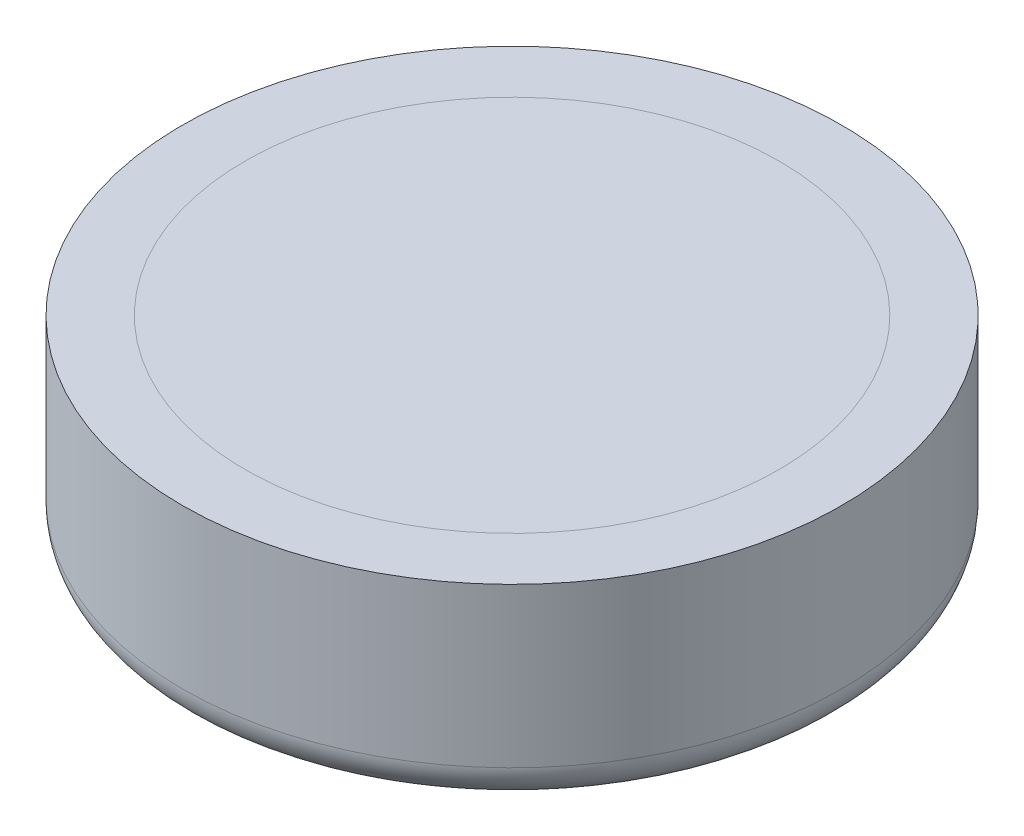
ISO-10303-21;
HEADER;
FILE_DESCRIPTION(('STEP AP214'),'2;1');
FILE_NAME('part.step','',(''),(''),'','','');
FILE_SCHEMA(('AUTOMOTIVE_DESIGN { 1 0 10303 214 1 1 1 1 }'));
ENDSEC;
DATA;
#1=APPLICATION_CONTEXT('core data for automotive mechanical design processes');
#2=APPLICATION_PROTOCOL_DEFINITION('international standard','automotive_design',2000,#1);
#3=PRODUCT_CONTEXT('',#1,'mechanical');
#4=PRODUCT('Part','Part','',(#3));
#5=PRODUCT_RELATED_PRODUCT_CATEGORY('part','',(#4));
#6=PRODUCT_DEFINITION_FORMATION('','',#4);
#7=PRODUCT_DEFINITION_CONTEXT('part definition',#1,'design');
#8=PRODUCT_DEFINITION('design','',#6,#7);
#9=PRODUCT_DEFINITION_SHAPE('','',#8);
#10=(LENGTH_UNIT() NAMED_UNIT(*) SI_UNIT(.MILLI.,.METRE.));
#11=(NAMED_UNIT(*) PLANE_ANGLE_UNIT() SI_UNIT($,.RADIAN.));
#12=(NAMED_UNIT(*) SI_UNIT($,.STERADIAN.) SOLID_ANGLE_UNIT());
#13=UNCERTAINTY_MEASURE_WITH_UNIT(LENGTH_MEASURE(1.E-05),#10,'distance_accuracy_value','');
#14=(GEOMETRIC_REPRESENTATION_CONTEXT(3) GLOBAL_UNCERTAINTY_ASSIGNED_CONTEXT((#13)) GLOBAL_UNIT_ASSIGNED_CONTEXT((#10,
#11,#12)) REPRESENTATION_CONTEXT('',''));
#15=CARTESIAN_POINT('',(0.,0.,0.));
#16=DIRECTION('',(0.,0.,1.));
#17=DIRECTION('',(1.,0.,0.));
#18=AXIS2_PLACEMENT_3D('',#15,#16,#17);
#19=CARTESIAN_POINT('',(0.,0.,0.));
#20=DIRECTION('',(0.,-1.,0.));
#21=DIRECTION('',(0.,0.,-1.));
#22=AXIS2_PLACEMENT_3D('',#19,#20,#21);
#23=PLANE('',#22);
#24=CARTESIAN_POINT('',(0.,0.,0.));
#25=DIRECTION('',(0.,1.,0.));
#26=DIRECTION('',(0.,0.,1.));
#27=AXIS2_PLACEMENT_3D('',#24,#25,#26);
#28=CIRCLE('',#27,34.255211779);
#29=CARTESIAN_POINT('',(0.,0.,34.255211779));
#30=VERTEX_POINT('',#29);
#31=EDGE_CURVE('E39',#30,#30,#28,.T.);
#32=ORIENTED_EDGE('',*,*,#31,.T.);
#33=EDGE_LOOP('',(#32));
#34=FACE_BOUND('',#33,.T.);
#35=CARTESIAN_POINT('',(0.,0.,0.));
#36=DIRECTION('',(0.,-1.,0.));
#37=DIRECTION('',(0.,0.,-1.));
#38=AXIS2_PLACEMENT_3D('',#35,#36,#37);
#39=CIRCLE('',#38,27.7632064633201);
#40=CARTESIAN_POINT('',(0.,0.,-27.7632064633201));
#41=VERTEX_POINT('',#40);
#42=EDGE_CURVE('E10',#41,#41,#39,.F.);
#43=ORIENTED_EDGE('',*,*,#42,.F.);
#44=EDGE_LOOP('',(#43));
#45=FACE_BOUND('',#44,.T.);
#46=ADVANCED_FACE('F31',(#34,#45),#23,.F.);
#47=CARTESIAN_POINT('',(0.,0.,0.));
#48=DIRECTION('',(0.,1.,0.));
#49=DIRECTION('',(0.,0.,1.));
#50=AXIS2_PLACEMENT_3D('',#47,#48,#49);
#51=CYLINDRICAL_SURFACE('',#50,34.255211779);
#52=ORIENTED_EDGE('',*,*,#31,.F.);
#53=EDGE_LOOP('',(#52));
#54=FACE_BOUND('',#53,.T.);
#55=CARTESIAN_POINT('',(0.,-16.5099999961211,0.));
#56=DIRECTION('',(0.,1.,0.));
#57=DIRECTION('',(0.,0.,1.));
#58=AXIS2_PLACEMENT_3D('',#55,#56,#57);
#59=CIRCLE('',#58,34.255211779);
#60=CARTESIAN_POINT('',(0.,-16.5099999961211,34.255211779));
#61=VERTEX_POINT('',#60);
#62=EDGE_CURVE('E49',#61,#61,#59,.T.);
#63=ORIENTED_EDGE('',*,*,#62,.T.);
#64=EDGE_LOOP('',(#63));
#65=FACE_BOUND('',#64,.T.);
#66=ADVANCED_FACE('F33',(#54,#65),#51,.T.);
#67=ORIENTED_EDGE('',*,*,#42,.T.);
#68=EDGE_LOOP('',(#67));
#69=FACE_BOUND('',#68,.T.);
#70=ADVANCED_FACE('F64',(#69),#23,.F.);
#71=CARTESIAN_POINT('',(30.4452117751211,-20.32,0.));
#72=DIRECTION('',(0.,1.,0.));
#73=DIRECTION('',(0.,0.,1.));
#74=AXIS2_PLACEMENT_3D('',#71,#72,#73);
#75=PLANE('',#74);
#76=CARTESIAN_POINT('',(0.,-20.32,0.));
#77=DIRECTION('',(0.,1.,0.));
#78=DIRECTION('',(0.,0.,1.));
#79=AXIS2_PLACEMENT_3D('',#76,#77,#78);
#80=CIRCLE('',#79,30.4452117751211);
#81=CARTESIAN_POINT('',(0.,-20.32,30.4452117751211));
#82=VERTEX_POINT('',#81);
#83=EDGE_CURVE('E45',#82,#82,#80,.T.);
#84=ORIENTED_EDGE('',*,*,#83,.F.);
#85=EDGE_LOOP('',(#84));
#86=FACE_BOUND('',#85,.T.);
#87=ADVANCED_FACE('F59',(#86),#75,.F.);
#88=CARTESIAN_POINT('',(0.,-16.5099999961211,0.));
#89=DIRECTION('',(0.,1.,0.));
#90=DIRECTION('',(0.,0.,1.));
#91=AXIS2_PLACEMENT_3D('',#88,#89,#90);
#92=TOROIDAL_SURFACE('',#91,30.4452117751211,3.81000000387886);
#93=ORIENTED_EDGE('',*,*,#62,.F.);
#94=EDGE_LOOP('',(#93));
#95=FACE_BOUND('',#94,.T.);
#96=ORIENTED_EDGE('',*,*,#83,.T.);
#97=EDGE_LOOP('',(#96));
#98=FACE_BOUND('',#97,.T.);
#99=ADVANCED_FACE('F56',(#95,#98),#92,.T.);
#100=CLOSED_SHELL('',(#46,#66,#70,#87,#99));
#101=MANIFOLD_SOLID_BREP('B2',#100);
#102=ADVANCED_BREP_SHAPE_REPRESENTATION('',(#18,#101),#14);
#103=SHAPE_DEFINITION_REPRESENTATION(#9,#102);
ENDSEC;
END-ISO-10303-21;
